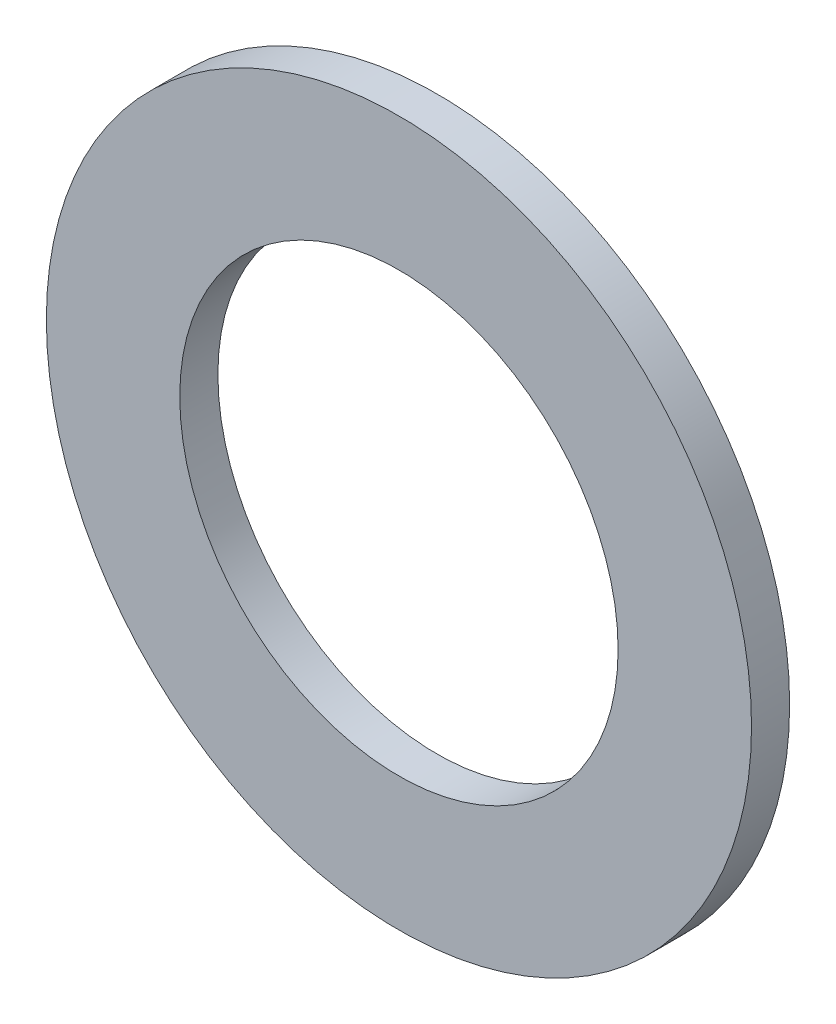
ISO-10303-21;
HEADER;
FILE_DESCRIPTION(('STEP AP214'),'2;1');
FILE_NAME('part.step','',(''),(''),'','','');
FILE_SCHEMA(('AUTOMOTIVE_DESIGN { 1 0 10303 214 1 1 1 1 }'));
ENDSEC;
DATA;
#1=APPLICATION_CONTEXT('core data for automotive mechanical design processes');
#2=APPLICATION_PROTOCOL_DEFINITION('international standard','automotive_design',2000,#1);
#3=PRODUCT_CONTEXT('',#1,'mechanical');
#4=PRODUCT('Part','Part','',(#3));
#5=PRODUCT_RELATED_PRODUCT_CATEGORY('part','',(#4));
#6=PRODUCT_DEFINITION_FORMATION('','',#4);
#7=PRODUCT_DEFINITION_CONTEXT('part definition',#1,'design');
#8=PRODUCT_DEFINITION('design','',#6,#7);
#9=PRODUCT_DEFINITION_SHAPE('','',#8);
#10=(LENGTH_UNIT() NAMED_UNIT(*) SI_UNIT(.MILLI.,.METRE.));
#11=(NAMED_UNIT(*) PLANE_ANGLE_UNIT() SI_UNIT($,.RADIAN.));
#12=(NAMED_UNIT(*) SI_UNIT($,.STERADIAN.) SOLID_ANGLE_UNIT());
#13=UNCERTAINTY_MEASURE_WITH_UNIT(LENGTH_MEASURE(1.E-05),#10,'distance_accuracy_value','');
#14=(GEOMETRIC_REPRESENTATION_CONTEXT(3) GLOBAL_UNCERTAINTY_ASSIGNED_CONTEXT((#13)) GLOBAL_UNIT_ASSIGNED_CONTEXT((#10,
#11,#12)) REPRESENTATION_CONTEXT('',''));
#15=CARTESIAN_POINT('',(0.,0.,0.));
#16=DIRECTION('',(0.,0.,1.));
#17=DIRECTION('',(1.,0.,0.));
#18=AXIS2_PLACEMENT_3D('',#15,#16,#17);
#19=CARTESIAN_POINT('',(0.,0.,2.));
#20=DIRECTION('',(0.,0.,1.));
#21=DIRECTION('',(1.,0.,0.));
#22=AXIS2_PLACEMENT_3D('',#19,#20,#21);
#23=PLANE('',#22);
#24=CARTESIAN_POINT('',(0.,0.,2.));
#25=DIRECTION('',(0.,0.,1.));
#26=DIRECTION('',(1.,0.,0.));
#27=AXIS2_PLACEMENT_3D('',#24,#25,#26);
#28=CIRCLE('',#27,18.5);
#29=CARTESIAN_POINT('',(18.5,0.,2.));
#30=VERTEX_POINT('',#29);
#31=EDGE_CURVE('E10',#30,#30,#28,.T.);
#32=ORIENTED_EDGE('',*,*,#31,.T.);
#33=EDGE_LOOP('',(#32));
#34=FACE_BOUND('',#33,.T.);
#35=CARTESIAN_POINT('',(0.,0.,2.));
#36=DIRECTION('',(0.,0.,1.));
#37=DIRECTION('',(1.,0.,0.));
#38=AXIS2_PLACEMENT_3D('',#35,#36,#37);
#39=CIRCLE('',#38,11.5);
#40=CARTESIAN_POINT('',(11.5,0.,2.));
#41=VERTEX_POINT('',#40);
#42=EDGE_CURVE('E35',#41,#41,#39,.T.);
#43=ORIENTED_EDGE('',*,*,#42,.F.);
#44=EDGE_LOOP('',(#43));
#45=FACE_BOUND('',#44,.T.);
#46=ADVANCED_FACE('F24',(#34,#45),#23,.T.);
#47=CARTESIAN_POINT('',(0.,0.,0.));
#48=DIRECTION('',(0.,0.,1.));
#49=DIRECTION('',(1.,0.,0.));
#50=AXIS2_PLACEMENT_3D('',#47,#48,#49);
#51=PLANE('',#50);
#52=CARTESIAN_POINT('',(0.,0.,0.));
#53=DIRECTION('',(0.,0.,1.));
#54=DIRECTION('',(1.,0.,0.));
#55=AXIS2_PLACEMENT_3D('',#52,#53,#54);
#56=CIRCLE('',#55,18.5);
#57=CARTESIAN_POINT('',(18.5,0.,0.));
#58=VERTEX_POINT('',#57);
#59=EDGE_CURVE('E31',#58,#58,#56,.T.);
#60=ORIENTED_EDGE('',*,*,#59,.F.);
#61=EDGE_LOOP('',(#60));
#62=FACE_BOUND('',#61,.T.);
#63=CARTESIAN_POINT('',(0.,0.,0.));
#64=DIRECTION('',(0.,0.,1.));
#65=DIRECTION('',(1.,0.,0.));
#66=AXIS2_PLACEMENT_3D('',#63,#64,#65);
#67=CIRCLE('',#66,11.5);
#68=CARTESIAN_POINT('',(11.5,0.,0.));
#69=VERTEX_POINT('',#68);
#70=EDGE_CURVE('E39',#69,#69,#67,.T.);
#71=ORIENTED_EDGE('',*,*,#70,.T.);
#72=EDGE_LOOP('',(#71));
#73=FACE_BOUND('',#72,.T.);
#74=ADVANCED_FACE('F45',(#62,#73),#51,.F.);
#75=CARTESIAN_POINT('',(0.,0.,2.));
#76=DIRECTION('',(0.,0.,-1.));
#77=DIRECTION('',(-1.,0.,0.));
#78=AXIS2_PLACEMENT_3D('',#75,#76,#77);
#79=CYLINDRICAL_SURFACE('',#78,18.5);
#80=ORIENTED_EDGE('',*,*,#31,.F.);
#81=EDGE_LOOP('',(#80));
#82=FACE_BOUND('',#81,.T.);
#83=ORIENTED_EDGE('',*,*,#59,.T.);
#84=EDGE_LOOP('',(#83));
#85=FACE_BOUND('',#84,.T.);
#86=ADVANCED_FACE('F26',(#82,#85),#79,.T.);
#87=CARTESIAN_POINT('',(0.,0.,2.));
#88=DIRECTION('',(0.,0.,-1.));
#89=DIRECTION('',(-1.,0.,0.));
#90=AXIS2_PLACEMENT_3D('',#87,#88,#89);
#91=CYLINDRICAL_SURFACE('',#90,11.5);
#92=ORIENTED_EDGE('',*,*,#42,.T.);
#93=EDGE_LOOP('',(#92));
#94=FACE_BOUND('',#93,.T.);
#95=ORIENTED_EDGE('',*,*,#70,.F.);
#96=EDGE_LOOP('',(#95));
#97=FACE_BOUND('',#96,.T.);
#98=ADVANCED_FACE('F47',(#94,#97),#91,.F.);
#99=CLOSED_SHELL('',(#46,#74,#86,#98));
#100=MANIFOLD_SOLID_BREP('B2',#99);
#101=ADVANCED_BREP_SHAPE_REPRESENTATION('',(#18,#100),#14);
#102=SHAPE_DEFINITION_REPRESENTATION(#9,#101);
ENDSEC;
END-ISO-10303-21;
